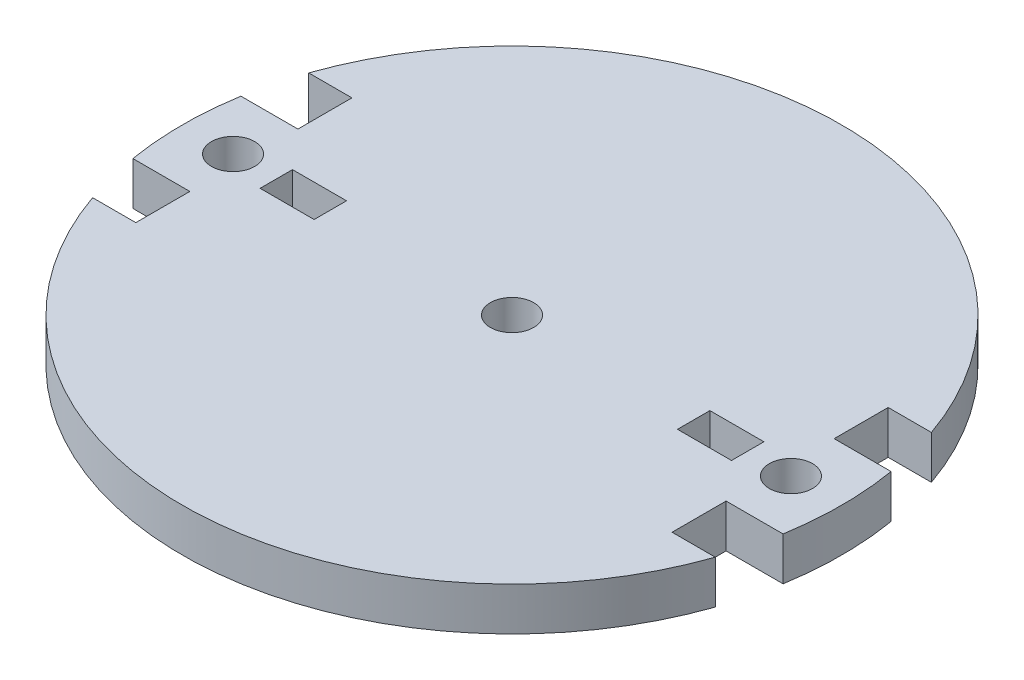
ISO-10303-21;
HEADER;
FILE_DESCRIPTION(('STEP AP214'),'2;1');
FILE_NAME('part.step','',(''),(''),'','','');
FILE_SCHEMA(('AUTOMOTIVE_DESIGN { 1 0 10303 214 1 1 1 1 }'));
ENDSEC;
DATA;
#1=APPLICATION_CONTEXT('core data for automotive mechanical design processes');
#2=APPLICATION_PROTOCOL_DEFINITION('international standard','automotive_design',2000,#1);
#3=PRODUCT_CONTEXT('',#1,'mechanical');
#4=PRODUCT('Part','Part','',(#3));
#5=PRODUCT_RELATED_PRODUCT_CATEGORY('part','',(#4));
#6=PRODUCT_DEFINITION_FORMATION('','',#4);
#7=PRODUCT_DEFINITION_CONTEXT('part definition',#1,'design');
#8=PRODUCT_DEFINITION('design','',#6,#7);
#9=PRODUCT_DEFINITION_SHAPE('','',#8);
#10=(LENGTH_UNIT() NAMED_UNIT(*) SI_UNIT(.MILLI.,.METRE.));
#11=(NAMED_UNIT(*) PLANE_ANGLE_UNIT() SI_UNIT($,.RADIAN.));
#12=(NAMED_UNIT(*) SI_UNIT($,.STERADIAN.) SOLID_ANGLE_UNIT());
#13=UNCERTAINTY_MEASURE_WITH_UNIT(LENGTH_MEASURE(1.E-05),#10,'distance_accuracy_value','');
#14=(GEOMETRIC_REPRESENTATION_CONTEXT(3) GLOBAL_UNCERTAINTY_ASSIGNED_CONTEXT((#13)) GLOBAL_UNIT_ASSIGNED_CONTEXT((#10,
#11,#12)) REPRESENTATION_CONTEXT('',''));
#15=CARTESIAN_POINT('',(0.,0.,0.));
#16=DIRECTION('',(0.,0.,1.));
#17=DIRECTION('',(1.,0.,0.));
#18=AXIS2_PLACEMENT_3D('',#15,#16,#17);
#19=CARTESIAN_POINT('',(0.,4.,0.));
#20=DIRECTION('',(0.,1.,0.));
#21=DIRECTION('',(0.,0.,1.));
#22=AXIS2_PLACEMENT_3D('',#19,#20,#21);
#23=PLANE('',#22);
#24=CARTESIAN_POINT('',(-25.8140590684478,4.,0.));
#25=DIRECTION('',(0.,1.,0.));
#26=DIRECTION('',(0.,0.,1.));
#27=AXIS2_PLACEMENT_3D('',#24,#25,#26);
#28=CIRCLE('',#27,2.);
#29=CARTESIAN_POINT('',(-25.8140590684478,4.,2.));
#30=VERTEX_POINT('',#29);
#31=EDGE_CURVE('E486',#30,#30,#28,.T.);
#32=ORIENTED_EDGE('',*,*,#31,.F.);
#33=EDGE_LOOP('',(#32));
#34=FACE_BOUND('',#33,.T.);
#35=CARTESIAN_POINT('',(25.8140590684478,4.,0.));
#36=DIRECTION('',(0.,1.,0.));
#37=DIRECTION('',(0.,0.,-1.));
#38=AXIS2_PLACEMENT_3D('',#35,#36,#37);
#39=CIRCLE('',#38,2.);
#40=CARTESIAN_POINT('',(25.8140590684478,4.,-2.));
#41=VERTEX_POINT('',#40);
#42=EDGE_CURVE('E222',#41,#41,#39,.T.);
#43=ORIENTED_EDGE('',*,*,#42,.F.);
#44=EDGE_LOOP('',(#43));
#45=FACE_BOUND('',#44,.T.);
#46=DIRECTION('',(1.,0.,0.));
#47=VECTOR('',#46,1.);
#48=CARTESIAN_POINT('',(-16.8140590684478,4.,1.5));
#49=LINE('',#48,#47);
#50=CARTESIAN_POINT('',(-21.8140590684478,4.,1.5));
#51=VERTEX_POINT('',#50);
#52=CARTESIAN_POINT('',(-16.8140590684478,4.,1.5));
#53=VERTEX_POINT('',#52);
#54=EDGE_CURVE('E52',#51,#53,#49,.T.);
#55=ORIENTED_EDGE('',*,*,#54,.F.);
#56=DIRECTION('',(0.,0.,1.));
#57=VECTOR('',#56,1.);
#58=CARTESIAN_POINT('',(-21.8140590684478,4.,1.5));
#59=LINE('',#58,#57);
#60=CARTESIAN_POINT('',(-21.8140590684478,4.,-1.5));
#61=VERTEX_POINT('',#60);
#62=EDGE_CURVE('E216',#61,#51,#59,.T.);
#63=ORIENTED_EDGE('',*,*,#62,.F.);
#64=DIRECTION('',(-1.,0.,0.));
#65=VECTOR('',#64,1.);
#66=CARTESIAN_POINT('',(-16.8140590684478,4.,-1.5));
#67=LINE('',#66,#65);
#68=CARTESIAN_POINT('',(-16.8140590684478,4.,-1.5));
#69=VERTEX_POINT('',#68);
#70=EDGE_CURVE('E219',#69,#61,#67,.T.);
#71=ORIENTED_EDGE('',*,*,#70,.F.);
#72=DIRECTION('',(0.,0.,-1.));
#73=VECTOR('',#72,1.);
#74=CARTESIAN_POINT('',(-16.8140590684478,4.,-1.5));
#75=LINE('',#74,#73);
#76=EDGE_CURVE('E228',#53,#69,#75,.T.);
#77=ORIENTED_EDGE('',*,*,#76,.F.);
#78=EDGE_LOOP('',(#55,#63,#71,#77));
#79=FACE_BOUND('',#78,.T.);
#80=DIRECTION('',(0.,0.,1.));
#81=VECTOR('',#80,1.);
#82=CARTESIAN_POINT('',(16.8140590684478,4.,-1.5));
#83=LINE('',#82,#81);
#84=CARTESIAN_POINT('',(16.8140590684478,4.,-1.5));
#85=VERTEX_POINT('',#84);
#86=CARTESIAN_POINT('',(16.8140590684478,4.,1.5));
#87=VERTEX_POINT('',#86);
#88=EDGE_CURVE('E235',#85,#87,#83,.T.);
#89=ORIENTED_EDGE('',*,*,#88,.F.);
#90=DIRECTION('',(-1.,0.,0.));
#91=VECTOR('',#90,1.);
#92=CARTESIAN_POINT('',(16.8140590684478,4.,-1.5));
#93=LINE('',#92,#91);
#94=CARTESIAN_POINT('',(21.8140590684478,4.,-1.5));
#95=VERTEX_POINT('',#94);
#96=EDGE_CURVE('E243',#95,#85,#93,.T.);
#97=ORIENTED_EDGE('',*,*,#96,.F.);
#98=DIRECTION('',(0.,0.,-1.));
#99=VECTOR('',#98,1.);
#100=CARTESIAN_POINT('',(21.8140590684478,4.,1.5));
#101=LINE('',#100,#99);
#102=CARTESIAN_POINT('',(21.8140590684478,4.,1.5));
#103=VERTEX_POINT('',#102);
#104=EDGE_CURVE('E257',#103,#95,#101,.T.);
#105=ORIENTED_EDGE('',*,*,#104,.F.);
#106=DIRECTION('',(1.,0.,0.));
#107=VECTOR('',#106,1.);
#108=CARTESIAN_POINT('',(16.8140590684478,4.,1.5));
#109=LINE('',#108,#107);
#110=EDGE_CURVE('E254',#87,#103,#109,.T.);
#111=ORIENTED_EDGE('',*,*,#110,.F.);
#112=EDGE_LOOP('',(#89,#97,#105,#111));
#113=FACE_BOUND('',#112,.T.);
#114=CARTESIAN_POINT('',(0.,4.,0.));
#115=DIRECTION('',(0.,1.,0.));
#116=DIRECTION('',(0.,0.,1.));
#117=AXIS2_PLACEMENT_3D('',#114,#115,#116);
#118=CIRCLE('',#117,2.);
#119=CARTESIAN_POINT('',(0.,4.,2.));
#120=VERTEX_POINT('',#119);
#121=EDGE_CURVE('E366',#120,#120,#118,.T.);
#122=ORIENTED_EDGE('',*,*,#121,.F.);
#123=EDGE_LOOP('',(#122));
#124=FACE_BOUND('',#123,.T.);
#125=DIRECTION('',(0.,0.,1.));
#126=VECTOR('',#125,1.);
#127=CARTESIAN_POINT('',(24.8140590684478,4.,0.));
#128=LINE('',#127,#126);
#129=CARTESIAN_POINT('',(24.8140590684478,4.,5.));
#130=VERTEX_POINT('',#129);
#131=CARTESIAN_POINT('',(24.8140590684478,4.,10.));
#132=VERTEX_POINT('',#131);
#133=EDGE_CURVE('E264',#130,#132,#128,.T.);
#134=ORIENTED_EDGE('',*,*,#133,.F.);
#135=DIRECTION('',(1.,0.,0.));
#136=VECTOR('',#135,1.);
#137=CARTESIAN_POINT('',(0.,4.,5.));
#138=LINE('',#137,#136);
#139=CARTESIAN_POINT('',(30.0873727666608,4.,5.));
#140=VERTEX_POINT('',#139);
#141=EDGE_CURVE('E275',#130,#140,#138,.T.);
#142=ORIENTED_EDGE('',*,*,#141,.T.);
#143=CARTESIAN_POINT('',(0.,4.,0.));
#144=DIRECTION('',(0.,1.,0.));
#145=DIRECTION('',(0.,0.,1.));
#146=AXIS2_PLACEMENT_3D('',#143,#144,#145);
#147=CIRCLE('',#146,30.5);
#148=CARTESIAN_POINT('',(30.0873727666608,4.,-5.));
#149=VERTEX_POINT('',#148);
#150=EDGE_CURVE('E44',#140,#149,#147,.T.);
#151=ORIENTED_EDGE('',*,*,#150,.T.);
#152=DIRECTION('',(1.,0.,0.));
#153=VECTOR('',#152,1.);
#154=CARTESIAN_POINT('',(0.,4.,-5.00000000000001));
#155=LINE('',#154,#153);
#156=CARTESIAN_POINT('',(24.8140590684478,4.,-5.));
#157=VERTEX_POINT('',#156);
#158=EDGE_CURVE('E299',#157,#149,#155,.T.);
#159=ORIENTED_EDGE('',*,*,#158,.F.);
#160=DIRECTION('',(0.,0.,-1.));
#161=VECTOR('',#160,1.);
#162=CARTESIAN_POINT('',(24.8140590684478,4.,0.));
#163=LINE('',#162,#161);
#164=CARTESIAN_POINT('',(24.8140590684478,4.,-10.));
#165=VERTEX_POINT('',#164);
#166=EDGE_CURVE('E307',#157,#165,#163,.T.);
#167=ORIENTED_EDGE('',*,*,#166,.T.);
#168=DIRECTION('',(1.,0.,0.));
#169=VECTOR('',#168,1.);
#170=CARTESIAN_POINT('',(0.,4.,-10.));
#171=LINE('',#170,#169);
#172=CARTESIAN_POINT('',(28.8140590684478,4.,-10.));
#173=VERTEX_POINT('',#172);
#174=EDGE_CURVE('E289',#165,#173,#171,.T.);
#175=ORIENTED_EDGE('',*,*,#174,.T.);
#176=CARTESIAN_POINT('',(-28.8140590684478,4.,-10.));
#177=VERTEX_POINT('',#176);
#178=EDGE_CURVE('E432',#173,#177,#147,.T.);
#179=ORIENTED_EDGE('',*,*,#178,.T.);
#180=DIRECTION('',(-1.,0.,0.));
#181=VECTOR('',#180,1.);
#182=CARTESIAN_POINT('',(0.,4.,-10.));
#183=LINE('',#182,#181);
#184=CARTESIAN_POINT('',(-24.8140590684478,4.,-10.));
#185=VERTEX_POINT('',#184);
#186=EDGE_CURVE('E324',#185,#177,#183,.T.);
#187=ORIENTED_EDGE('',*,*,#186,.F.);
#188=DIRECTION('',(0.,0.,-1.));
#189=VECTOR('',#188,1.);
#190=CARTESIAN_POINT('',(-24.8140590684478,4.,0.));
#191=LINE('',#190,#189);
#192=CARTESIAN_POINT('',(-24.8140590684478,4.,-5.));
#193=VERTEX_POINT('',#192);
#194=EDGE_CURVE('E333',#193,#185,#191,.T.);
#195=ORIENTED_EDGE('',*,*,#194,.F.);
#196=DIRECTION('',(-1.,0.,0.));
#197=VECTOR('',#196,1.);
#198=CARTESIAN_POINT('',(0.,4.,-5.));
#199=LINE('',#198,#197);
#200=CARTESIAN_POINT('',(-30.0873727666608,4.,-5.));
#201=VERTEX_POINT('',#200);
#202=EDGE_CURVE('E314',#193,#201,#199,.T.);
#203=ORIENTED_EDGE('',*,*,#202,.T.);
#204=CARTESIAN_POINT('',(-30.0873727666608,4.,5.));
#205=VERTEX_POINT('',#204);
#206=EDGE_CURVE('E45',#201,#205,#147,.T.);
#207=ORIENTED_EDGE('',*,*,#206,.T.);
#208=DIRECTION('',(-1.,0.,0.));
#209=VECTOR('',#208,1.);
#210=CARTESIAN_POINT('',(0.,4.,5.00000000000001));
#211=LINE('',#210,#209);
#212=CARTESIAN_POINT('',(-24.8140590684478,4.,5.));
#213=VERTEX_POINT('',#212);
#214=EDGE_CURVE('E340',#213,#205,#211,.T.);
#215=ORIENTED_EDGE('',*,*,#214,.F.);
#216=DIRECTION('',(0.,0.,1.));
#217=VECTOR('',#216,1.);
#218=CARTESIAN_POINT('',(-24.8140590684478,4.,0.));
#219=LINE('',#218,#217);
#220=CARTESIAN_POINT('',(-24.8140590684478,4.,10.));
#221=VERTEX_POINT('',#220);
#222=EDGE_CURVE('E351',#213,#221,#219,.T.);
#223=ORIENTED_EDGE('',*,*,#222,.T.);
#224=DIRECTION('',(-1.,0.,0.));
#225=VECTOR('',#224,1.);
#226=CARTESIAN_POINT('',(0.,4.,10.));
#227=LINE('',#226,#225);
#228=CARTESIAN_POINT('',(-28.8140590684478,4.,10.));
#229=VERTEX_POINT('',#228);
#230=EDGE_CURVE('E359',#221,#229,#227,.T.);
#231=ORIENTED_EDGE('',*,*,#230,.T.);
#232=CARTESIAN_POINT('',(28.8140590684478,4.,10.));
#233=VERTEX_POINT('',#232);
#234=EDGE_CURVE('E11',#229,#233,#147,.T.);
#235=ORIENTED_EDGE('',*,*,#234,.T.);
#236=DIRECTION('',(1.,0.,0.));
#237=VECTOR('',#236,1.);
#238=CARTESIAN_POINT('',(0.,4.,10.));
#239=LINE('',#238,#237);
#240=EDGE_CURVE('E283',#132,#233,#239,.T.);
#241=ORIENTED_EDGE('',*,*,#240,.F.);
#242=EDGE_LOOP('',(#134,#142,#151,#159,#167,#175,#179,#187,#195,#203,#207,#215,#223,#231,#235,#241));
#243=FACE_BOUND('',#242,.T.);
#244=ADVANCED_FACE('F35',(#34,#45,#79,#113,#124,#243),#23,.T.);
#245=CARTESIAN_POINT('',(0.,0.,0.));
#246=DIRECTION('',(0.,1.,0.));
#247=DIRECTION('',(0.,0.,1.));
#248=AXIS2_PLACEMENT_3D('',#245,#246,#247);
#249=PLANE('',#248);
#250=CARTESIAN_POINT('',(-25.8140590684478,0.,0.));
#251=DIRECTION('',(0.,1.,0.));
#252=DIRECTION('',(0.,0.,1.));
#253=AXIS2_PLACEMENT_3D('',#250,#251,#252);
#254=CIRCLE('',#253,2.);
#255=CARTESIAN_POINT('',(-25.8140590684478,0.,2.));
#256=VERTEX_POINT('',#255);
#257=EDGE_CURVE('E480',#256,#256,#254,.T.);
#258=ORIENTED_EDGE('',*,*,#257,.T.);
#259=EDGE_LOOP('',(#258));
#260=FACE_BOUND('',#259,.T.);
#261=CARTESIAN_POINT('',(25.8140590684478,0.,0.));
#262=DIRECTION('',(0.,1.,0.));
#263=DIRECTION('',(0.,0.,-1.));
#264=AXIS2_PLACEMENT_3D('',#261,#262,#263);
#265=CIRCLE('',#264,2.);
#266=CARTESIAN_POINT('',(25.8140590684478,0.,-2.));
#267=VERTEX_POINT('',#266);
#268=EDGE_CURVE('E229',#267,#267,#265,.T.);
#269=ORIENTED_EDGE('',*,*,#268,.T.);
#270=EDGE_LOOP('',(#269));
#271=FACE_BOUND('',#270,.T.);
#272=DIRECTION('',(0.,0.,1.));
#273=VECTOR('',#272,1.);
#274=CARTESIAN_POINT('',(-21.8140590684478,0.,1.5));
#275=LINE('',#274,#273);
#276=CARTESIAN_POINT('',(-21.8140590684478,0.,-1.5));
#277=VERTEX_POINT('',#276);
#278=CARTESIAN_POINT('',(-21.8140590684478,0.,1.5));
#279=VERTEX_POINT('',#278);
#280=EDGE_CURVE('E206',#277,#279,#275,.T.);
#281=ORIENTED_EDGE('',*,*,#280,.T.);
#282=DIRECTION('',(1.,0.,0.));
#283=VECTOR('',#282,1.);
#284=CARTESIAN_POINT('',(-16.8140590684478,0.,1.5));
#285=LINE('',#284,#283);
#286=CARTESIAN_POINT('',(-16.8140590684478,0.,1.5));
#287=VERTEX_POINT('',#286);
#288=EDGE_CURVE('E200',#279,#287,#285,.T.);
#289=ORIENTED_EDGE('',*,*,#288,.T.);
#290=DIRECTION('',(0.,0.,-1.));
#291=VECTOR('',#290,1.);
#292=CARTESIAN_POINT('',(-16.8140590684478,0.,-1.5));
#293=LINE('',#292,#291);
#294=CARTESIAN_POINT('',(-16.8140590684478,0.,-1.5));
#295=VERTEX_POINT('',#294);
#296=EDGE_CURVE('E209',#287,#295,#293,.T.);
#297=ORIENTED_EDGE('',*,*,#296,.T.);
#298=DIRECTION('',(-1.,0.,0.));
#299=VECTOR('',#298,1.);
#300=CARTESIAN_POINT('',(-16.8140590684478,0.,-1.5));
#301=LINE('',#300,#299);
#302=EDGE_CURVE('E60',#295,#277,#301,.T.);
#303=ORIENTED_EDGE('',*,*,#302,.T.);
#304=EDGE_LOOP('',(#281,#289,#297,#303));
#305=FACE_BOUND('',#304,.T.);
#306=DIRECTION('',(-1.,0.,0.));
#307=VECTOR('',#306,1.);
#308=CARTESIAN_POINT('',(16.8140590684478,0.,-1.5));
#309=LINE('',#308,#307);
#310=CARTESIAN_POINT('',(21.8140590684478,0.,-1.5));
#311=VERTEX_POINT('',#310);
#312=CARTESIAN_POINT('',(16.8140590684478,0.,-1.5));
#313=VERTEX_POINT('',#312);
#314=EDGE_CURVE('E249',#311,#313,#309,.T.);
#315=ORIENTED_EDGE('',*,*,#314,.T.);
#316=DIRECTION('',(0.,0.,1.));
#317=VECTOR('',#316,1.);
#318=CARTESIAN_POINT('',(16.8140590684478,0.,-1.5));
#319=LINE('',#318,#317);
#320=CARTESIAN_POINT('',(16.8140590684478,0.,1.5));
#321=VERTEX_POINT('',#320);
#322=EDGE_CURVE('E239',#313,#321,#319,.T.);
#323=ORIENTED_EDGE('',*,*,#322,.T.);
#324=DIRECTION('',(1.,0.,0.));
#325=VECTOR('',#324,1.);
#326=CARTESIAN_POINT('',(16.8140590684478,0.,1.5));
#327=LINE('',#326,#325);
#328=CARTESIAN_POINT('',(21.8140590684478,0.,1.5));
#329=VERTEX_POINT('',#328);
#330=EDGE_CURVE('E242',#321,#329,#327,.T.);
#331=ORIENTED_EDGE('',*,*,#330,.T.);
#332=DIRECTION('',(0.,0.,-1.));
#333=VECTOR('',#332,1.);
#334=CARTESIAN_POINT('',(21.8140590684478,0.,1.5));
#335=LINE('',#334,#333);
#336=EDGE_CURVE('E246',#329,#311,#335,.T.);
#337=ORIENTED_EDGE('',*,*,#336,.T.);
#338=EDGE_LOOP('',(#315,#323,#331,#337));
#339=FACE_BOUND('',#338,.T.);
#340=CARTESIAN_POINT('',(0.,0.,0.));
#341=DIRECTION('',(0.,1.,0.));
#342=DIRECTION('',(0.,0.,1.));
#343=AXIS2_PLACEMENT_3D('',#340,#341,#342);
#344=CIRCLE('',#343,2.);
#345=CARTESIAN_POINT('',(0.,0.,2.));
#346=VERTEX_POINT('',#345);
#347=EDGE_CURVE('E373',#346,#346,#344,.T.);
#348=ORIENTED_EDGE('',*,*,#347,.T.);
#349=EDGE_LOOP('',(#348));
#350=FACE_BOUND('',#349,.T.);
#351=DIRECTION('',(1.,0.,0.));
#352=VECTOR('',#351,1.);
#353=CARTESIAN_POINT('',(0.,0.,5.));
#354=LINE('',#353,#352);
#355=CARTESIAN_POINT('',(24.8140590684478,0.,5.));
#356=VERTEX_POINT('',#355);
#357=CARTESIAN_POINT('',(30.0873727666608,0.,5.));
#358=VERTEX_POINT('',#357);
#359=EDGE_CURVE('E278',#356,#358,#354,.T.);
#360=ORIENTED_EDGE('',*,*,#359,.F.);
#361=DIRECTION('',(0.,0.,1.));
#362=VECTOR('',#361,1.);
#363=CARTESIAN_POINT('',(24.8140590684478,0.,0.));
#364=LINE('',#363,#362);
#365=CARTESIAN_POINT('',(24.8140590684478,0.,10.));
#366=VERTEX_POINT('',#365);
#367=EDGE_CURVE('E271',#356,#366,#364,.T.);
#368=ORIENTED_EDGE('',*,*,#367,.T.);
#369=DIRECTION('',(1.,0.,0.));
#370=VECTOR('',#369,1.);
#371=CARTESIAN_POINT('',(0.,0.,10.));
#372=LINE('',#371,#370);
#373=CARTESIAN_POINT('',(28.8140590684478,0.,10.));
#374=VERTEX_POINT('',#373);
#375=EDGE_CURVE('E274',#366,#374,#372,.T.);
#376=ORIENTED_EDGE('',*,*,#375,.T.);
#377=CARTESIAN_POINT('',(0.,0.,0.));
#378=DIRECTION('',(0.,1.,0.));
#379=DIRECTION('',(0.,0.,1.));
#380=AXIS2_PLACEMENT_3D('',#377,#378,#379);
#381=CIRCLE('',#380,30.5);
#382=CARTESIAN_POINT('',(-28.8140590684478,0.,10.));
#383=VERTEX_POINT('',#382);
#384=EDGE_CURVE('E39',#383,#374,#381,.T.);
#385=ORIENTED_EDGE('',*,*,#384,.F.);
#386=DIRECTION('',(-1.,0.,0.));
#387=VECTOR('',#386,1.);
#388=CARTESIAN_POINT('',(0.,0.,10.));
#389=LINE('',#388,#387);
#390=CARTESIAN_POINT('',(-24.8140590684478,0.,10.));
#391=VERTEX_POINT('',#390);
#392=EDGE_CURVE('E350',#391,#383,#389,.T.);
#393=ORIENTED_EDGE('',*,*,#392,.F.);
#394=DIRECTION('',(0.,0.,1.));
#395=VECTOR('',#394,1.);
#396=CARTESIAN_POINT('',(-24.8140590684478,0.,0.));
#397=LINE('',#396,#395);
#398=CARTESIAN_POINT('',(-24.8140590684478,0.,5.));
#399=VERTEX_POINT('',#398);
#400=EDGE_CURVE('E353',#399,#391,#397,.T.);
#401=ORIENTED_EDGE('',*,*,#400,.F.);
#402=DIRECTION('',(-1.,0.,0.));
#403=VECTOR('',#402,1.);
#404=CARTESIAN_POINT('',(0.,0.,5.00000000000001));
#405=LINE('',#404,#403);
#406=CARTESIAN_POINT('',(-30.0873727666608,0.,5.));
#407=VERTEX_POINT('',#406);
#408=EDGE_CURVE('E347',#399,#407,#405,.T.);
#409=ORIENTED_EDGE('',*,*,#408,.T.);
#410=CARTESIAN_POINT('',(-30.0873727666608,0.,-5.));
#411=VERTEX_POINT('',#410);
#412=EDGE_CURVE('E376',#411,#407,#381,.T.);
#413=ORIENTED_EDGE('',*,*,#412,.F.);
#414=DIRECTION('',(-1.,0.,0.));
#415=VECTOR('',#414,1.);
#416=CARTESIAN_POINT('',(0.,0.,-5.));
#417=LINE('',#416,#415);
#418=CARTESIAN_POINT('',(-24.8140590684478,0.,-5.));
#419=VERTEX_POINT('',#418);
#420=EDGE_CURVE('E321',#419,#411,#417,.T.);
#421=ORIENTED_EDGE('',*,*,#420,.F.);
#422=DIRECTION('',(0.,0.,-1.));
#423=VECTOR('',#422,1.);
#424=CARTESIAN_POINT('',(-24.8140590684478,0.,0.));
#425=LINE('',#424,#423);
#426=CARTESIAN_POINT('',(-24.8140590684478,0.,-10.));
#427=VERTEX_POINT('',#426);
#428=EDGE_CURVE('E323',#419,#427,#425,.T.);
#429=ORIENTED_EDGE('',*,*,#428,.T.);
#430=DIRECTION('',(-1.,0.,0.));
#431=VECTOR('',#430,1.);
#432=CARTESIAN_POINT('',(0.,0.,-10.));
#433=LINE('',#432,#431);
#434=CARTESIAN_POINT('',(-28.8140590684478,0.,-10.));
#435=VERTEX_POINT('',#434);
#436=EDGE_CURVE('E327',#427,#435,#433,.T.);
#437=ORIENTED_EDGE('',*,*,#436,.T.);
#438=CARTESIAN_POINT('',(28.8140590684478,0.,-10.));
#439=VERTEX_POINT('',#438);
#440=EDGE_CURVE('E406',#439,#435,#381,.T.);
#441=ORIENTED_EDGE('',*,*,#440,.F.);
#442=DIRECTION('',(1.,0.,0.));
#443=VECTOR('',#442,1.);
#444=CARTESIAN_POINT('',(0.,0.,-10.));
#445=LINE('',#444,#443);
#446=CARTESIAN_POINT('',(24.8140590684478,0.,-10.));
#447=VERTEX_POINT('',#446);
#448=EDGE_CURVE('E296',#447,#439,#445,.T.);
#449=ORIENTED_EDGE('',*,*,#448,.F.);
#450=DIRECTION('',(0.,0.,-1.));
#451=VECTOR('',#450,1.);
#452=CARTESIAN_POINT('',(24.8140590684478,0.,0.));
#453=LINE('',#452,#451);
#454=CARTESIAN_POINT('',(24.8140590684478,0.,-5.));
#455=VERTEX_POINT('',#454);
#456=EDGE_CURVE('E298',#455,#447,#453,.T.);
#457=ORIENTED_EDGE('',*,*,#456,.F.);
#458=DIRECTION('',(1.,0.,0.));
#459=VECTOR('',#458,1.);
#460=CARTESIAN_POINT('',(0.,0.,-5.00000000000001));
#461=LINE('',#460,#459);
#462=CARTESIAN_POINT('',(30.0873727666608,0.,-5.));
#463=VERTEX_POINT('',#462);
#464=EDGE_CURVE('E301',#455,#463,#461,.T.);
#465=ORIENTED_EDGE('',*,*,#464,.T.);
#466=EDGE_CURVE('E401',#358,#463,#381,.T.);
#467=ORIENTED_EDGE('',*,*,#466,.F.);
#468=EDGE_LOOP('',(#360,#368,#376,#385,#393,#401,#409,#413,#421,#429,#437,#441,#449,#457,#465,#467));
#469=FACE_BOUND('',#468,.T.);
#470=ADVANCED_FACE('F213',(#260,#271,#305,#339,#350,#469),#249,.F.);
#471=CARTESIAN_POINT('',(0.,4.,0.));
#472=DIRECTION('',(0.,-1.,0.));
#473=DIRECTION('',(0.,0.,-1.));
#474=AXIS2_PLACEMENT_3D('',#471,#472,#473);
#475=CYLINDRICAL_SURFACE('',#474,30.5);
#476=DIRECTION('',(0.,1.,0.));
#477=VECTOR('',#476,1.);
#478=CARTESIAN_POINT('',(30.0873727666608,0.,5.));
#479=LINE('',#478,#477);
#480=EDGE_CURVE('E290',#358,#140,#479,.T.);
#481=ORIENTED_EDGE('',*,*,#480,.F.);
#482=ORIENTED_EDGE('',*,*,#466,.T.);
#483=DIRECTION('',(0.,1.,0.));
#484=VECTOR('',#483,1.);
#485=CARTESIAN_POINT('',(30.0873727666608,0.,-5.));
#486=LINE('',#485,#484);
#487=EDGE_CURVE('E315',#463,#149,#486,.T.);
#488=ORIENTED_EDGE('',*,*,#487,.T.);
#489=ORIENTED_EDGE('',*,*,#150,.F.);
#490=EDGE_LOOP('',(#481,#482,#488,#489));
#491=FACE_BOUND('',#490,.T.);
#492=ADVANCED_FACE('F400',(#491),#475,.T.);
#493=DIRECTION('',(0.,1.,0.));
#494=VECTOR('',#493,1.);
#495=CARTESIAN_POINT('',(28.8140590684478,0.,-10.));
#496=LINE('',#495,#494);
#497=EDGE_CURVE('E312',#439,#173,#496,.T.);
#498=ORIENTED_EDGE('',*,*,#497,.F.);
#499=ORIENTED_EDGE('',*,*,#440,.T.);
#500=DIRECTION('',(0.,1.,0.));
#501=VECTOR('',#500,1.);
#502=CARTESIAN_POINT('',(-28.8140590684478,0.,-10.));
#503=LINE('',#502,#501);
#504=EDGE_CURVE('E341',#435,#177,#503,.T.);
#505=ORIENTED_EDGE('',*,*,#504,.T.);
#506=ORIENTED_EDGE('',*,*,#178,.F.);
#507=EDGE_LOOP('',(#498,#499,#505,#506));
#508=FACE_BOUND('',#507,.T.);
#509=ADVANCED_FACE('F444',(#508),#475,.T.);
#510=DIRECTION('',(0.,1.,0.));
#511=VECTOR('',#510,1.);
#512=CARTESIAN_POINT('',(-30.0873727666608,0.,-5.));
#513=LINE('',#512,#511);
#514=EDGE_CURVE('E338',#411,#201,#513,.T.);
#515=ORIENTED_EDGE('',*,*,#514,.F.);
#516=ORIENTED_EDGE('',*,*,#412,.T.);
#517=DIRECTION('',(0.,1.,0.));
#518=VECTOR('',#517,1.);
#519=CARTESIAN_POINT('',(-30.0873727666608,0.,5.));
#520=LINE('',#519,#518);
#521=EDGE_CURVE('E356',#407,#205,#520,.T.);
#522=ORIENTED_EDGE('',*,*,#521,.T.);
#523=ORIENTED_EDGE('',*,*,#206,.F.);
#524=EDGE_LOOP('',(#515,#516,#522,#523));
#525=FACE_BOUND('',#524,.T.);
#526=ADVANCED_FACE('F416',(#525),#475,.T.);
#527=ORIENTED_EDGE('',*,*,#384,.T.);
#528=DIRECTION('',(0.,1.,0.));
#529=VECTOR('',#528,1.);
#530=CARTESIAN_POINT('',(28.8140590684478,0.,10.));
#531=LINE('',#530,#529);
#532=EDGE_CURVE('E292',#374,#233,#531,.T.);
#533=ORIENTED_EDGE('',*,*,#532,.T.);
#534=ORIENTED_EDGE('',*,*,#234,.F.);
#535=DIRECTION('',(0.,1.,0.));
#536=VECTOR('',#535,1.);
#537=CARTESIAN_POINT('',(-28.8140590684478,0.,10.));
#538=LINE('',#537,#536);
#539=EDGE_CURVE('E369',#383,#229,#538,.T.);
#540=ORIENTED_EDGE('',*,*,#539,.F.);
#541=EDGE_LOOP('',(#527,#533,#534,#540));
#542=FACE_BOUND('',#541,.T.);
#543=ADVANCED_FACE('F37',(#542),#475,.T.);
#544=CARTESIAN_POINT('',(0.,0.,0.));
#545=DIRECTION('',(0.,1.,0.));
#546=DIRECTION('',(0.,0.,1.));
#547=AXIS2_PLACEMENT_3D('',#544,#545,#546);
#548=CYLINDRICAL_SURFACE('',#547,2.);
#549=ORIENTED_EDGE('',*,*,#347,.F.);
#550=EDGE_LOOP('',(#549));
#551=FACE_BOUND('',#550,.T.);
#552=ORIENTED_EDGE('',*,*,#121,.T.);
#553=EDGE_LOOP('',(#552));
#554=FACE_BOUND('',#553,.T.);
#555=ADVANCED_FACE('F380',(#551,#554),#548,.F.);
#556=CARTESIAN_POINT('',(0.,0.,5.00000000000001));
#557=DIRECTION('',(0.,0.,-1.));
#558=DIRECTION('',(-1.,0.,0.));
#559=AXIS2_PLACEMENT_3D('',#556,#557,#558);
#560=PLANE('',#559);
#561=ORIENTED_EDGE('',*,*,#214,.T.);
#562=ORIENTED_EDGE('',*,*,#521,.F.);
#563=ORIENTED_EDGE('',*,*,#408,.F.);
#564=DIRECTION('',(0.,1.,0.));
#565=VECTOR('',#564,1.);
#566=CARTESIAN_POINT('',(-24.8140590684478,0.,5.));
#567=LINE('',#566,#565);
#568=EDGE_CURVE('E364',#399,#213,#567,.T.);
#569=ORIENTED_EDGE('',*,*,#568,.T.);
#570=EDGE_LOOP('',(#561,#562,#563,#569));
#571=FACE_BOUND('',#570,.T.);
#572=ADVANCED_FACE('F421',(#571),#560,.F.);
#573=CARTESIAN_POINT('',(-24.8140590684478,0.,0.));
#574=DIRECTION('',(-1.,0.,0.));
#575=DIRECTION('',(0.,0.,1.));
#576=AXIS2_PLACEMENT_3D('',#573,#574,#575);
#577=PLANE('',#576);
#578=ORIENTED_EDGE('',*,*,#222,.F.);
#579=ORIENTED_EDGE('',*,*,#568,.F.);
#580=ORIENTED_EDGE('',*,*,#400,.T.);
#581=DIRECTION('',(0.,1.,0.));
#582=VECTOR('',#581,1.);
#583=CARTESIAN_POINT('',(-24.8140590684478,0.,10.));
#584=LINE('',#583,#582);
#585=EDGE_CURVE('E367',#391,#221,#584,.T.);
#586=ORIENTED_EDGE('',*,*,#585,.T.);
#587=EDGE_LOOP('',(#578,#579,#580,#586));
#588=FACE_BOUND('',#587,.T.);
#589=ADVANCED_FACE('F428',(#588),#577,.T.);
#590=CARTESIAN_POINT('',(0.,0.,10.));
#591=DIRECTION('',(0.,0.,-1.));
#592=DIRECTION('',(-1.,0.,0.));
#593=AXIS2_PLACEMENT_3D('',#590,#591,#592);
#594=PLANE('',#593);
#595=ORIENTED_EDGE('',*,*,#230,.F.);
#596=ORIENTED_EDGE('',*,*,#585,.F.);
#597=ORIENTED_EDGE('',*,*,#392,.T.);
#598=ORIENTED_EDGE('',*,*,#539,.T.);
#599=EDGE_LOOP('',(#595,#596,#597,#598));
#600=FACE_BOUND('',#599,.T.);
#601=ADVANCED_FACE('F455',(#600),#594,.T.);
#602=CARTESIAN_POINT('',(0.,0.,-5.));
#603=DIRECTION('',(0.,0.,-1.));
#604=DIRECTION('',(-1.,0.,0.));
#605=AXIS2_PLACEMENT_3D('',#602,#603,#604);
#606=PLANE('',#605);
#607=ORIENTED_EDGE('',*,*,#202,.F.);
#608=DIRECTION('',(0.,1.,0.));
#609=VECTOR('',#608,1.);
#610=CARTESIAN_POINT('',(-24.8140590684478,0.,-5.));
#611=LINE('',#610,#609);
#612=EDGE_CURVE('E330',#419,#193,#611,.T.);
#613=ORIENTED_EDGE('',*,*,#612,.F.);
#614=ORIENTED_EDGE('',*,*,#420,.T.);
#615=ORIENTED_EDGE('',*,*,#514,.T.);
#616=EDGE_LOOP('',(#607,#613,#614,#615));
#617=FACE_BOUND('',#616,.T.);
#618=ADVANCED_FACE('F453',(#617),#606,.T.);
#619=CARTESIAN_POINT('',(0.,0.,-10.));
#620=DIRECTION('',(0.,0.,-1.));
#621=DIRECTION('',(-1.,0.,0.));
#622=AXIS2_PLACEMENT_3D('',#619,#620,#621);
#623=PLANE('',#622);
#624=ORIENTED_EDGE('',*,*,#186,.T.);
#625=ORIENTED_EDGE('',*,*,#504,.F.);
#626=ORIENTED_EDGE('',*,*,#436,.F.);
#627=DIRECTION('',(0.,1.,0.));
#628=VECTOR('',#627,1.);
#629=CARTESIAN_POINT('',(-24.8140590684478,0.,-10.));
#630=LINE('',#629,#628);
#631=EDGE_CURVE('E344',#427,#185,#630,.T.);
#632=ORIENTED_EDGE('',*,*,#631,.T.);
#633=EDGE_LOOP('',(#624,#625,#626,#632));
#634=FACE_BOUND('',#633,.T.);
#635=ADVANCED_FACE('F446',(#634),#623,.F.);
#636=CARTESIAN_POINT('',(-24.8140590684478,0.,0.));
#637=DIRECTION('',(1.,0.,0.));
#638=DIRECTION('',(0.,0.,-1.));
#639=AXIS2_PLACEMENT_3D('',#636,#637,#638);
#640=PLANE('',#639);
#641=ORIENTED_EDGE('',*,*,#194,.T.);
#642=ORIENTED_EDGE('',*,*,#631,.F.);
#643=ORIENTED_EDGE('',*,*,#428,.F.);
#644=ORIENTED_EDGE('',*,*,#612,.T.);
#645=EDGE_LOOP('',(#641,#642,#643,#644));
#646=FACE_BOUND('',#645,.T.);
#647=ADVANCED_FACE('F451',(#646),#640,.F.);
#648=CARTESIAN_POINT('',(0.,0.,-10.));
#649=DIRECTION('',(0.,0.,1.));
#650=DIRECTION('',(1.,0.,0.));
#651=AXIS2_PLACEMENT_3D('',#648,#649,#650);
#652=PLANE('',#651);
#653=ORIENTED_EDGE('',*,*,#174,.F.);
#654=DIRECTION('',(0.,1.,0.));
#655=VECTOR('',#654,1.);
#656=CARTESIAN_POINT('',(24.8140590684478,0.,-10.));
#657=LINE('',#656,#655);
#658=EDGE_CURVE('E304',#447,#165,#657,.T.);
#659=ORIENTED_EDGE('',*,*,#658,.F.);
#660=ORIENTED_EDGE('',*,*,#448,.T.);
#661=ORIENTED_EDGE('',*,*,#497,.T.);
#662=EDGE_LOOP('',(#653,#659,#660,#661));
#663=FACE_BOUND('',#662,.T.);
#664=ADVANCED_FACE('F536',(#663),#652,.T.);
#665=CARTESIAN_POINT('',(0.,0.,-5.00000000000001));
#666=DIRECTION('',(0.,0.,1.));
#667=DIRECTION('',(1.,0.,0.));
#668=AXIS2_PLACEMENT_3D('',#665,#666,#667);
#669=PLANE('',#668);
#670=ORIENTED_EDGE('',*,*,#158,.T.);
#671=ORIENTED_EDGE('',*,*,#487,.F.);
#672=ORIENTED_EDGE('',*,*,#464,.F.);
#673=DIRECTION('',(0.,1.,0.));
#674=VECTOR('',#673,1.);
#675=CARTESIAN_POINT('',(24.8140590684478,0.,-5.));
#676=LINE('',#675,#674);
#677=EDGE_CURVE('E318',#455,#157,#676,.T.);
#678=ORIENTED_EDGE('',*,*,#677,.T.);
#679=EDGE_LOOP('',(#670,#671,#672,#678));
#680=FACE_BOUND('',#679,.T.);
#681=ADVANCED_FACE('F437',(#680),#669,.F.);
#682=CARTESIAN_POINT('',(24.8140590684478,0.,0.));
#683=DIRECTION('',(1.,0.,0.));
#684=DIRECTION('',(0.,0.,-1.));
#685=AXIS2_PLACEMENT_3D('',#682,#683,#684);
#686=PLANE('',#685);
#687=ORIENTED_EDGE('',*,*,#166,.F.);
#688=ORIENTED_EDGE('',*,*,#677,.F.);
#689=ORIENTED_EDGE('',*,*,#456,.T.);
#690=ORIENTED_EDGE('',*,*,#658,.T.);
#691=EDGE_LOOP('',(#687,#688,#689,#690));
#692=FACE_BOUND('',#691,.T.);
#693=ADVANCED_FACE('F440',(#692),#686,.T.);
#694=CARTESIAN_POINT('',(24.8140590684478,0.,0.));
#695=DIRECTION('',(-1.,0.,0.));
#696=DIRECTION('',(0.,0.,1.));
#697=AXIS2_PLACEMENT_3D('',#694,#695,#696);
#698=PLANE('',#697);
#699=ORIENTED_EDGE('',*,*,#133,.T.);
#700=DIRECTION('',(0.,1.,0.));
#701=VECTOR('',#700,1.);
#702=CARTESIAN_POINT('',(24.8140590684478,0.,10.));
#703=LINE('',#702,#701);
#704=EDGE_CURVE('E280',#366,#132,#703,.T.);
#705=ORIENTED_EDGE('',*,*,#704,.F.);
#706=ORIENTED_EDGE('',*,*,#367,.F.);
#707=DIRECTION('',(0.,1.,0.));
#708=VECTOR('',#707,1.);
#709=CARTESIAN_POINT('',(24.8140590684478,0.,5.));
#710=LINE('',#709,#708);
#711=EDGE_CURVE('E287',#356,#130,#710,.T.);
#712=ORIENTED_EDGE('',*,*,#711,.T.);
#713=EDGE_LOOP('',(#699,#705,#706,#712));
#714=FACE_BOUND('',#713,.T.);
#715=ADVANCED_FACE('F391',(#714),#698,.F.);
#716=CARTESIAN_POINT('',(0.,0.,5.));
#717=DIRECTION('',(0.,0.,1.));
#718=DIRECTION('',(1.,0.,0.));
#719=AXIS2_PLACEMENT_3D('',#716,#717,#718);
#720=PLANE('',#719);
#721=ORIENTED_EDGE('',*,*,#141,.F.);
#722=ORIENTED_EDGE('',*,*,#711,.F.);
#723=ORIENTED_EDGE('',*,*,#359,.T.);
#724=ORIENTED_EDGE('',*,*,#480,.T.);
#725=EDGE_LOOP('',(#721,#722,#723,#724));
#726=FACE_BOUND('',#725,.T.);
#727=ADVANCED_FACE('F396',(#726),#720,.T.);
#728=CARTESIAN_POINT('',(0.,0.,10.));
#729=DIRECTION('',(0.,0.,1.));
#730=DIRECTION('',(1.,0.,0.));
#731=AXIS2_PLACEMENT_3D('',#728,#729,#730);
#732=PLANE('',#731);
#733=ORIENTED_EDGE('',*,*,#240,.T.);
#734=ORIENTED_EDGE('',*,*,#532,.F.);
#735=ORIENTED_EDGE('',*,*,#375,.F.);
#736=ORIENTED_EDGE('',*,*,#704,.T.);
#737=EDGE_LOOP('',(#733,#734,#735,#736));
#738=FACE_BOUND('',#737,.T.);
#739=ADVANCED_FACE('F526',(#738),#732,.F.);
#740=CARTESIAN_POINT('',(16.8140590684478,0.,-1.5));
#741=DIRECTION('',(-1.,0.,0.));
#742=DIRECTION('',(0.,0.,1.));
#743=AXIS2_PLACEMENT_3D('',#740,#741,#742);
#744=PLANE('',#743);
#745=ORIENTED_EDGE('',*,*,#88,.T.);
#746=DIRECTION('',(0.,1.,0.));
#747=VECTOR('',#746,1.);
#748=CARTESIAN_POINT('',(16.8140590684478,0.,1.5));
#749=LINE('',#748,#747);
#750=EDGE_CURVE('E252',#321,#87,#749,.T.);
#751=ORIENTED_EDGE('',*,*,#750,.F.);
#752=ORIENTED_EDGE('',*,*,#322,.F.);
#753=DIRECTION('',(0.,1.,0.));
#754=VECTOR('',#753,1.);
#755=CARTESIAN_POINT('',(16.8140590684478,0.,-1.5));
#756=LINE('',#755,#754);
#757=EDGE_CURVE('E262',#313,#85,#756,.T.);
#758=ORIENTED_EDGE('',*,*,#757,.T.);
#759=EDGE_LOOP('',(#745,#751,#752,#758));
#760=FACE_BOUND('',#759,.T.);
#761=ADVANCED_FACE('F502',(#760),#744,.F.);
#762=CARTESIAN_POINT('',(16.8140590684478,0.,-1.5));
#763=DIRECTION('',(0.,0.,-1.));
#764=DIRECTION('',(-1.,0.,0.));
#765=AXIS2_PLACEMENT_3D('',#762,#763,#764);
#766=PLANE('',#765);
#767=ORIENTED_EDGE('',*,*,#96,.T.);
#768=ORIENTED_EDGE('',*,*,#757,.F.);
#769=ORIENTED_EDGE('',*,*,#314,.F.);
#770=DIRECTION('',(0.,1.,0.));
#771=VECTOR('',#770,1.);
#772=CARTESIAN_POINT('',(21.8140590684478,0.,-1.5));
#773=LINE('',#772,#771);
#774=EDGE_CURVE('E265',#311,#95,#773,.T.);
#775=ORIENTED_EDGE('',*,*,#774,.T.);
#776=EDGE_LOOP('',(#767,#768,#769,#775));
#777=FACE_BOUND('',#776,.T.);
#778=ADVANCED_FACE('F511',(#777),#766,.F.);
#779=CARTESIAN_POINT('',(21.8140590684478,0.,1.5));
#780=DIRECTION('',(1.,0.,0.));
#781=DIRECTION('',(0.,0.,-1.));
#782=AXIS2_PLACEMENT_3D('',#779,#780,#781);
#783=PLANE('',#782);
#784=ORIENTED_EDGE('',*,*,#104,.T.);
#785=ORIENTED_EDGE('',*,*,#774,.F.);
#786=ORIENTED_EDGE('',*,*,#336,.F.);
#787=DIRECTION('',(0.,1.,0.));
#788=VECTOR('',#787,1.);
#789=CARTESIAN_POINT('',(21.8140590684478,0.,1.5));
#790=LINE('',#789,#788);
#791=EDGE_CURVE('E267',#329,#103,#790,.T.);
#792=ORIENTED_EDGE('',*,*,#791,.T.);
#793=EDGE_LOOP('',(#784,#785,#786,#792));
#794=FACE_BOUND('',#793,.T.);
#795=ADVANCED_FACE('F513',(#794),#783,.F.);
#796=CARTESIAN_POINT('',(16.8140590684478,0.,1.5));
#797=DIRECTION('',(0.,0.,1.));
#798=DIRECTION('',(1.,0.,0.));
#799=AXIS2_PLACEMENT_3D('',#796,#797,#798);
#800=PLANE('',#799);
#801=ORIENTED_EDGE('',*,*,#110,.T.);
#802=ORIENTED_EDGE('',*,*,#791,.F.);
#803=ORIENTED_EDGE('',*,*,#330,.F.);
#804=ORIENTED_EDGE('',*,*,#750,.T.);
#805=EDGE_LOOP('',(#801,#802,#803,#804));
#806=FACE_BOUND('',#805,.T.);
#807=ADVANCED_FACE('F506',(#806),#800,.F.);
#808=CARTESIAN_POINT('',(-16.8140590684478,0.,1.5));
#809=DIRECTION('',(0.,0.,1.));
#810=DIRECTION('',(1.,0.,0.));
#811=AXIS2_PLACEMENT_3D('',#808,#809,#810);
#812=PLANE('',#811);
#813=ORIENTED_EDGE('',*,*,#54,.T.);
#814=DIRECTION('',(0.,1.,0.));
#815=VECTOR('',#814,1.);
#816=CARTESIAN_POINT('',(-16.8140590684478,0.,1.5));
#817=LINE('',#816,#815);
#818=EDGE_CURVE('E196',#287,#53,#817,.T.);
#819=ORIENTED_EDGE('',*,*,#818,.F.);
#820=ORIENTED_EDGE('',*,*,#288,.F.);
#821=DIRECTION('',(0.,1.,0.));
#822=VECTOR('',#821,1.);
#823=CARTESIAN_POINT('',(-21.8140590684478,0.,1.5));
#824=LINE('',#823,#822);
#825=EDGE_CURVE('E233',#279,#51,#824,.T.);
#826=ORIENTED_EDGE('',*,*,#825,.T.);
#827=EDGE_LOOP('',(#813,#819,#820,#826));
#828=FACE_BOUND('',#827,.T.);
#829=ADVANCED_FACE('F198',(#828),#812,.F.);
#830=CARTESIAN_POINT('',(-21.8140590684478,0.,1.5));
#831=DIRECTION('',(-1.,0.,0.));
#832=DIRECTION('',(0.,0.,1.));
#833=AXIS2_PLACEMENT_3D('',#830,#831,#832);
#834=PLANE('',#833);
#835=ORIENTED_EDGE('',*,*,#62,.T.);
#836=ORIENTED_EDGE('',*,*,#825,.F.);
#837=ORIENTED_EDGE('',*,*,#280,.F.);
#838=DIRECTION('',(0.,1.,0.));
#839=VECTOR('',#838,1.);
#840=CARTESIAN_POINT('',(-21.8140590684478,0.,-1.5));
#841=LINE('',#840,#839);
#842=EDGE_CURVE('E236',#277,#61,#841,.T.);
#843=ORIENTED_EDGE('',*,*,#842,.T.);
#844=EDGE_LOOP('',(#835,#836,#837,#843));
#845=FACE_BOUND('',#844,.T.);
#846=ADVANCED_FACE('F641',(#845),#834,.F.);
#847=CARTESIAN_POINT('',(-16.8140590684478,0.,-1.5));
#848=DIRECTION('',(0.,0.,-1.));
#849=DIRECTION('',(-1.,0.,0.));
#850=AXIS2_PLACEMENT_3D('',#847,#848,#849);
#851=PLANE('',#850);
#852=ORIENTED_EDGE('',*,*,#70,.T.);
#853=ORIENTED_EDGE('',*,*,#842,.F.);
#854=ORIENTED_EDGE('',*,*,#302,.F.);
#855=DIRECTION('',(0.,1.,0.));
#856=VECTOR('',#855,1.);
#857=CARTESIAN_POINT('',(-16.8140590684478,0.,-1.5));
#858=LINE('',#857,#856);
#859=EDGE_CURVE('E205',#295,#69,#858,.T.);
#860=ORIENTED_EDGE('',*,*,#859,.T.);
#861=EDGE_LOOP('',(#852,#853,#854,#860));
#862=FACE_BOUND('',#861,.T.);
#863=ADVANCED_FACE('F630',(#862),#851,.F.);
#864=CARTESIAN_POINT('',(-16.8140590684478,0.,-1.5));
#865=DIRECTION('',(1.,0.,0.));
#866=DIRECTION('',(0.,0.,-1.));
#867=AXIS2_PLACEMENT_3D('',#864,#865,#866);
#868=PLANE('',#867);
#869=ORIENTED_EDGE('',*,*,#76,.T.);
#870=ORIENTED_EDGE('',*,*,#859,.F.);
#871=ORIENTED_EDGE('',*,*,#296,.F.);
#872=ORIENTED_EDGE('',*,*,#818,.T.);
#873=EDGE_LOOP('',(#869,#870,#871,#872));
#874=FACE_BOUND('',#873,.T.);
#875=ADVANCED_FACE('F210',(#874),#868,.F.);
#876=CARTESIAN_POINT('',(25.8140590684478,0.,0.));
#877=DIRECTION('',(0.,1.,0.));
#878=DIRECTION('',(0.,0.,1.));
#879=AXIS2_PLACEMENT_3D('',#876,#877,#878);
#880=CYLINDRICAL_SURFACE('',#879,2.);
#881=ORIENTED_EDGE('',*,*,#268,.F.);
#882=EDGE_LOOP('',(#881));
#883=FACE_BOUND('',#882,.T.);
#884=ORIENTED_EDGE('',*,*,#42,.T.);
#885=EDGE_LOOP('',(#884));
#886=FACE_BOUND('',#885,.T.);
#887=ADVANCED_FACE('F629',(#883,#886),#880,.F.);
#888=CARTESIAN_POINT('',(-25.8140590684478,0.,0.));
#889=DIRECTION('',(0.,1.,0.));
#890=DIRECTION('',(0.,0.,1.));
#891=AXIS2_PLACEMENT_3D('',#888,#889,#890);
#892=CYLINDRICAL_SURFACE('',#891,2.);
#893=ORIENTED_EDGE('',*,*,#257,.F.);
#894=EDGE_LOOP('',(#893));
#895=FACE_BOUND('',#894,.T.);
#896=ORIENTED_EDGE('',*,*,#31,.T.);
#897=EDGE_LOOP('',(#896));
#898=FACE_BOUND('',#897,.T.);
#899=ADVANCED_FACE('F491',(#895,#898),#892,.F.);
#900=CLOSED_SHELL('',(#244,#470,#492,#509,#526,#543,#555,#572,#589,#601,#618,#635,#647,#664,
#681,#693,#715,#727,#739,#761,#778,#795,#807,#829,#846,#863,#875,#887,#899));
#901=MANIFOLD_SOLID_BREP('B2',#900);
#902=ADVANCED_BREP_SHAPE_REPRESENTATION('',(#18,#901),#14);
#903=SHAPE_DEFINITION_REPRESENTATION(#9,#902);
ENDSEC;
END-ISO-10303-21;
